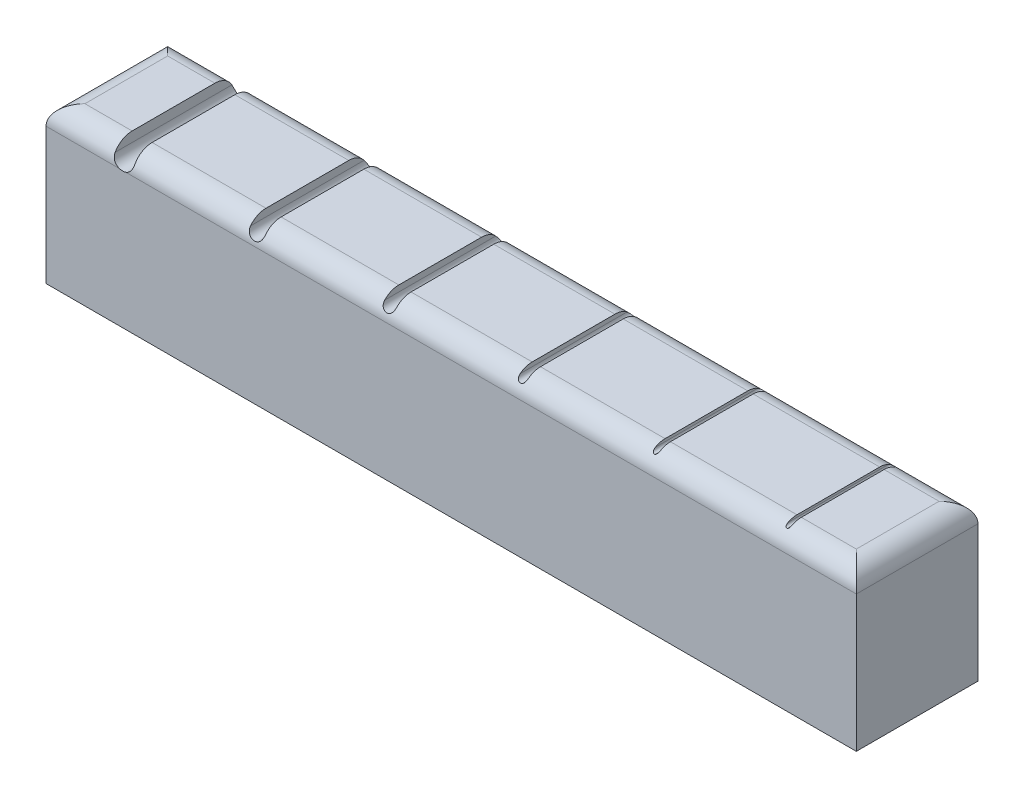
from build123d import *

# Parameters (mm, degrees)
SKETCH2_W               = 42.291
SKETCH2_H               = 8.128
BOSS_EXTRUDE1_DEPTH     = 3.175
FILLET1_R               = 1.016
CUT_EXTRUDE1_DEPTH      = 23.875252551
CUT_EXTRUDE1_DEPTH_BACK = 23.875252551


with BuildPart() as part:
    # Sketch2 → Boss-Extrude1 (new, symmetric)
    with BuildSketch(Plane.XY):
        with Locations((0, 4.064)):
            Rectangle(SKETCH2_W, SKETCH2_H)
    extrude(amount=BOSS_EXTRUDE1_DEPTH, both=True)

    # Fillet1
    fillet1_edges = [part.edges().sort_by_distance(p)[0] for p in [
        (0, 8.128, 3.175),
        (0, 8.128, -3.175),
        (-21.1455, 8.128, 0),
        (21.1455, 8.128, 0),
    ]]
    fillet(fillet1_edges, radius=FILLET1_R)

    # Sketch4 → Cut-Extrude1 (cut, two sides: drawn at the far end of the back side and taken through both)
    with BuildSketch(Plane.XY.offset(-CUT_EXTRUDE1_DEPTH_BACK)):
        with BuildLine():
            Line((-17.6657, 8.128), (-16.6243, 8.128))
            Line((-16.6243, 8.128), (-16.6243, 7.6073))
            ThreePointArc((-16.6243, 7.6073), (-17.145, 7.0866), (-17.6657, 7.6073))
            Line((-17.6657, 7.6073), (-17.6657, 8.128))
        make_face()
        with BuildLine():
            Line((-10.6807, 8.128), (-9.8933, 8.128))
            Line((-9.8933, 8.128), (-9.8933, 7.7343))
            ThreePointArc((-9.8933, 7.7343), (-10.287, 7.3406), (-10.6807, 7.7343))
            Line((-10.6807, 7.7343), (-10.6807, 8.128))
        make_face()
        with BuildLine():
            Line((-3.7465, 7.8105), (-3.7465, 8.128))
            Line((-3.7465, 8.128), (-3.1115, 8.128))
            Line((-3.1115, 8.128), (-3.1115, 7.8105))
            ThreePointArc((-3.1115, 7.8105), (-3.429, 7.493), (-3.7465, 7.8105))
        make_face()
        with BuildLine():
            Line((3.2131, 7.9121), (3.2131, 8.128))
            Line((3.2131, 8.128), (3.6449, 8.128))
            Line((3.6449, 8.128), (3.6449, 7.9121))
            ThreePointArc((3.6449, 7.9121), (3.429, 7.6962), (3.2131, 7.9121))
        make_face()
        with BuildLine():
            Line((10.1473, 7.9883), (10.1473, 8.128))
            Line((10.1473, 8.128), (10.4267, 8.128))
            Line((10.4267, 8.128), (10.4267, 7.9883))
            ThreePointArc((10.4267, 7.9883), (10.287, 7.8486), (10.1473, 7.9883))
        make_face()
        with BuildLine():
            Line((17.0307, 8.0137), (17.0307, 8.128))
            Line((17.0307, 8.128), (17.2593, 8.128))
            Line((17.2593, 8.128), (17.2593, 8.0137))
            ThreePointArc((17.2593, 8.0137), (17.145, 7.8994), (17.0307, 8.0137))
        make_face()
    extrude(amount=CUT_EXTRUDE1_DEPTH + CUT_EXTRUDE1_DEPTH_BACK, mode=Mode.SUBTRACT)


solid = part.part
